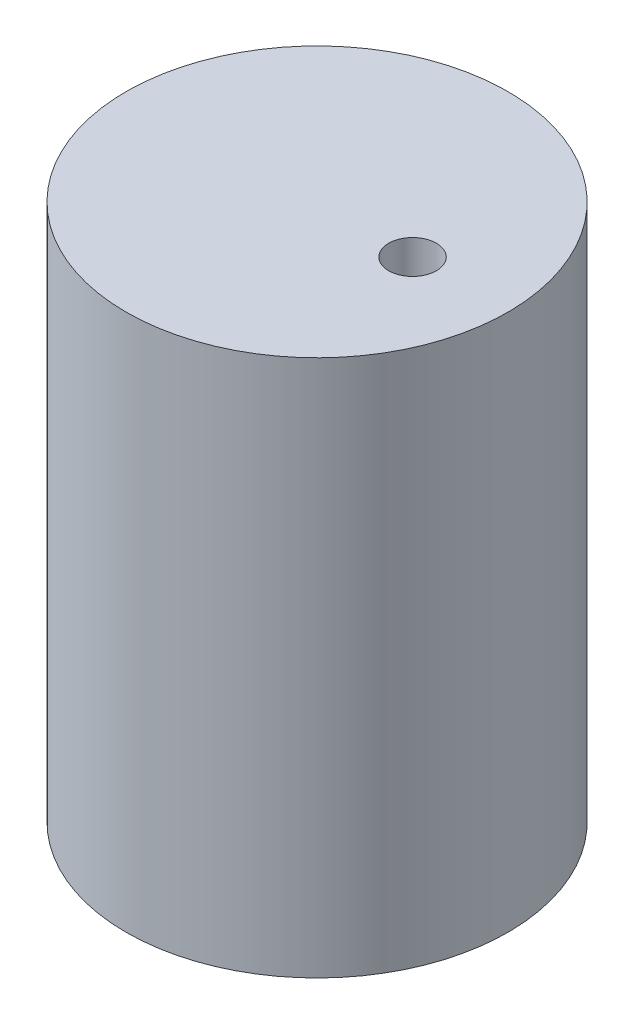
ISO-10303-21;
HEADER;
FILE_DESCRIPTION(('STEP AP214'),'2;1');
FILE_NAME('part.step','',(''),(''),'','','');
FILE_SCHEMA(('AUTOMOTIVE_DESIGN { 1 0 10303 214 1 1 1 1 }'));
ENDSEC;
DATA;
#1=APPLICATION_CONTEXT('core data for automotive mechanical design processes');
#2=APPLICATION_PROTOCOL_DEFINITION('international standard','automotive_design',2000,#1);
#3=PRODUCT_CONTEXT('',#1,'mechanical');
#4=PRODUCT('Part','Part','',(#3));
#5=PRODUCT_RELATED_PRODUCT_CATEGORY('part','',(#4));
#6=PRODUCT_DEFINITION_FORMATION('','',#4);
#7=PRODUCT_DEFINITION_CONTEXT('part definition',#1,'design');
#8=PRODUCT_DEFINITION('design','',#6,#7);
#9=PRODUCT_DEFINITION_SHAPE('','',#8);
#10=(LENGTH_UNIT() NAMED_UNIT(*) SI_UNIT(.MILLI.,.METRE.));
#11=(NAMED_UNIT(*) PLANE_ANGLE_UNIT() SI_UNIT($,.RADIAN.));
#12=(NAMED_UNIT(*) SI_UNIT($,.STERADIAN.) SOLID_ANGLE_UNIT());
#13=UNCERTAINTY_MEASURE_WITH_UNIT(LENGTH_MEASURE(1.E-05),#10,'distance_accuracy_value','');
#14=(GEOMETRIC_REPRESENTATION_CONTEXT(3) GLOBAL_UNCERTAINTY_ASSIGNED_CONTEXT((#13)) GLOBAL_UNIT_ASSIGNED_CONTEXT((#10,
#11,#12)) REPRESENTATION_CONTEXT('',''));
#15=CARTESIAN_POINT('',(0.,0.,0.));
#16=DIRECTION('',(0.,0.,1.));
#17=DIRECTION('',(1.,0.,0.));
#18=AXIS2_PLACEMENT_3D('',#15,#16,#17);
#19=CARTESIAN_POINT('',(0.,22.5,0.));
#20=DIRECTION('',(0.,1.,0.));
#21=DIRECTION('',(0.,0.,1.));
#22=AXIS2_PLACEMENT_3D('',#19,#20,#21);
#23=PLANE('',#22);
#24=CARTESIAN_POINT('',(0.,22.5,0.));
#25=DIRECTION('',(0.,1.,0.));
#26=DIRECTION('',(0.,0.,1.));
#27=AXIS2_PLACEMENT_3D('',#24,#25,#26);
#28=CIRCLE('',#27,8.);
#29=CARTESIAN_POINT('',(0.,22.5,8.));
#30=VERTEX_POINT('',#29);
#31=EDGE_CURVE('E9',#30,#30,#28,.T.);
#32=ORIENTED_EDGE('',*,*,#31,.T.);
#33=EDGE_LOOP('',(#32));
#34=FACE_BOUND('',#33,.T.);
#35=CARTESIAN_POINT('',(4.,22.5,0.));
#36=DIRECTION('',(0.,1.,0.));
#37=DIRECTION('',(0.,0.,1.));
#38=AXIS2_PLACEMENT_3D('',#35,#36,#37);
#39=CIRCLE('',#38,1.);
#40=CARTESIAN_POINT('',(4.,22.5,1.));
#41=VERTEX_POINT('',#40);
#42=EDGE_CURVE('E25',#41,#41,#39,.T.);
#43=ORIENTED_EDGE('',*,*,#42,.F.);
#44=EDGE_LOOP('',(#43));
#45=FACE_BOUND('',#44,.T.);
#46=ADVANCED_FACE('F14',(#34,#45),#23,.T.);
#47=CARTESIAN_POINT('',(0.,0.,0.));
#48=DIRECTION('',(0.,1.,0.));
#49=DIRECTION('',(0.,0.,1.));
#50=AXIS2_PLACEMENT_3D('',#47,#48,#49);
#51=PLANE('',#50);
#52=CARTESIAN_POINT('',(0.,0.,0.));
#53=DIRECTION('',(0.,1.,0.));
#54=DIRECTION('',(0.,0.,1.));
#55=AXIS2_PLACEMENT_3D('',#52,#53,#54);
#56=CIRCLE('',#55,8.);
#57=CARTESIAN_POINT('',(0.,0.,8.));
#58=VERTEX_POINT('',#57);
#59=EDGE_CURVE('E18',#58,#58,#56,.T.);
#60=ORIENTED_EDGE('',*,*,#59,.F.);
#61=EDGE_LOOP('',(#60));
#62=FACE_BOUND('',#61,.T.);
#63=CARTESIAN_POINT('',(4.,0.,0.));
#64=DIRECTION('',(0.,1.,0.));
#65=DIRECTION('',(0.,0.,1.));
#66=AXIS2_PLACEMENT_3D('',#63,#64,#65);
#67=CIRCLE('',#66,1.);
#68=CARTESIAN_POINT('',(4.,0.,1.));
#69=VERTEX_POINT('',#68);
#70=EDGE_CURVE('E27',#69,#69,#67,.T.);
#71=ORIENTED_EDGE('',*,*,#70,.T.);
#72=EDGE_LOOP('',(#71));
#73=FACE_BOUND('',#72,.T.);
#74=ADVANCED_FACE('F37',(#62,#73),#51,.F.);
#75=CARTESIAN_POINT('',(0.,22.5,0.));
#76=DIRECTION('',(0.,-1.,0.));
#77=DIRECTION('',(0.,0.,-1.));
#78=AXIS2_PLACEMENT_3D('',#75,#76,#77);
#79=CYLINDRICAL_SURFACE('',#78,8.);
#80=ORIENTED_EDGE('',*,*,#31,.F.);
#81=EDGE_LOOP('',(#80));
#82=FACE_BOUND('',#81,.T.);
#83=ORIENTED_EDGE('',*,*,#59,.T.);
#84=EDGE_LOOP('',(#83));
#85=FACE_BOUND('',#84,.T.);
#86=ADVANCED_FACE('F16',(#82,#85),#79,.T.);
#87=CARTESIAN_POINT('',(4.,22.5,0.));
#88=DIRECTION('',(0.,-1.,0.));
#89=DIRECTION('',(0.,0.,-1.));
#90=AXIS2_PLACEMENT_3D('',#87,#88,#89);
#91=CYLINDRICAL_SURFACE('',#90,1.);
#92=ORIENTED_EDGE('',*,*,#42,.T.);
#93=EDGE_LOOP('',(#92));
#94=FACE_BOUND('',#93,.T.);
#95=ORIENTED_EDGE('',*,*,#70,.F.);
#96=EDGE_LOOP('',(#95));
#97=FACE_BOUND('',#96,.T.);
#98=ADVANCED_FACE('F33',(#94,#97),#91,.F.);
#99=CLOSED_SHELL('',(#46,#74,#86,#98));
#100=MANIFOLD_SOLID_BREP('B1',#99);
#101=ADVANCED_BREP_SHAPE_REPRESENTATION('',(#18,#100),#14);
#102=SHAPE_DEFINITION_REPRESENTATION(#9,#101);
ENDSEC;
END-ISO-10303-21;
